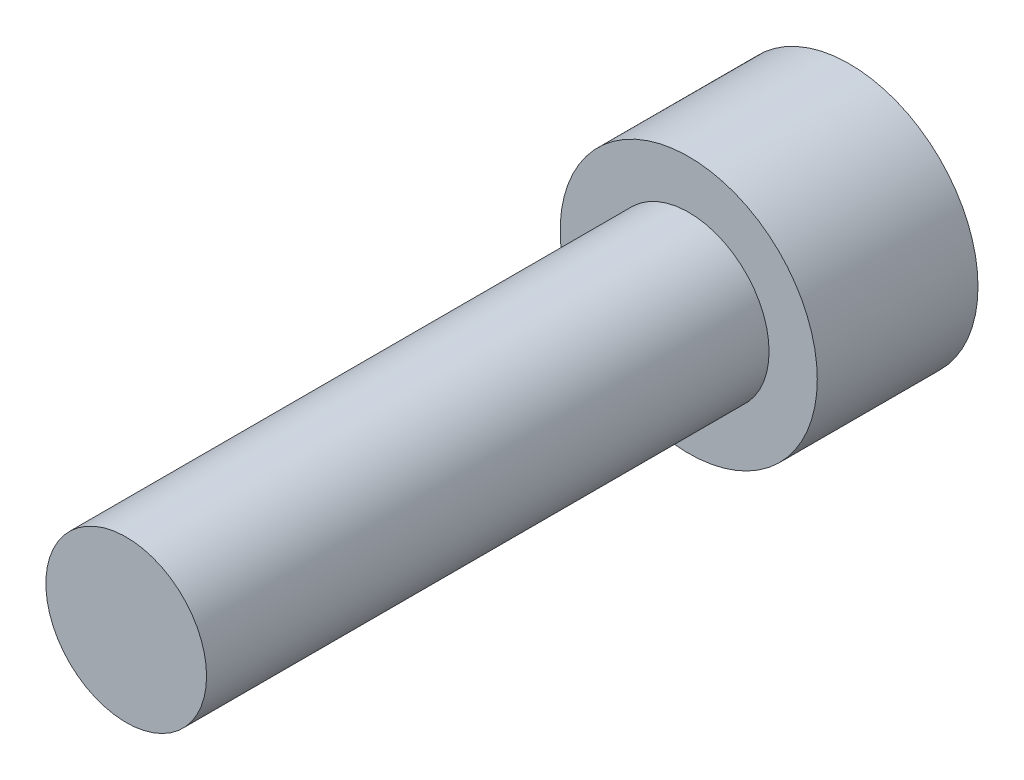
ISO-10303-21;
HEADER;
FILE_DESCRIPTION(('STEP AP214'),'2;1');
FILE_NAME('part.step','',(''),(''),'','','');
FILE_SCHEMA(('AUTOMOTIVE_DESIGN { 1 0 10303 214 1 1 1 1 }'));
ENDSEC;
DATA;
#1=APPLICATION_CONTEXT('core data for automotive mechanical design processes');
#2=APPLICATION_PROTOCOL_DEFINITION('international standard','automotive_design',2000,#1);
#3=PRODUCT_CONTEXT('',#1,'mechanical');
#4=PRODUCT('Part','Part','',(#3));
#5=PRODUCT_RELATED_PRODUCT_CATEGORY('part','',(#4));
#6=PRODUCT_DEFINITION_FORMATION('','',#4);
#7=PRODUCT_DEFINITION_CONTEXT('part definition',#1,'design');
#8=PRODUCT_DEFINITION('design','',#6,#7);
#9=PRODUCT_DEFINITION_SHAPE('','',#8);
#10=(LENGTH_UNIT() NAMED_UNIT(*) SI_UNIT(.MILLI.,.METRE.));
#11=(NAMED_UNIT(*) PLANE_ANGLE_UNIT() SI_UNIT($,.RADIAN.));
#12=(NAMED_UNIT(*) SI_UNIT($,.STERADIAN.) SOLID_ANGLE_UNIT());
#13=UNCERTAINTY_MEASURE_WITH_UNIT(LENGTH_MEASURE(1.E-05),#10,'distance_accuracy_value','');
#14=(GEOMETRIC_REPRESENTATION_CONTEXT(3) GLOBAL_UNCERTAINTY_ASSIGNED_CONTEXT((#13)) GLOBAL_UNIT_ASSIGNED_CONTEXT((#10,
#11,#12)) REPRESENTATION_CONTEXT('',''));
#15=CARTESIAN_POINT('',(0.,0.,0.));
#16=DIRECTION('',(0.,0.,1.));
#17=DIRECTION('',(1.,0.,0.));
#18=AXIS2_PLACEMENT_3D('',#15,#16,#17);
#19=CARTESIAN_POINT('',(0.,0.,35.));
#20=DIRECTION('',(0.,0.,1.));
#21=DIRECTION('',(1.,0.,0.));
#22=AXIS2_PLACEMENT_3D('',#19,#20,#21);
#23=PLANE('',#22);
#24=CARTESIAN_POINT('',(0.,0.,35.));
#25=DIRECTION('',(0.,0.,1.));
#26=DIRECTION('',(1.,0.,0.));
#27=AXIS2_PLACEMENT_3D('',#24,#25,#26);
#28=CIRCLE('',#27,5.);
#29=CARTESIAN_POINT('',(5.,0.,35.));
#30=VERTEX_POINT('',#29);
#31=EDGE_CURVE('E11',#30,#30,#28,.T.);
#32=ORIENTED_EDGE('',*,*,#31,.T.);
#33=EDGE_LOOP('',(#32));
#34=FACE_BOUND('',#33,.T.);
#35=ADVANCED_FACE('F32',(#34),#23,.T.);
#36=CARTESIAN_POINT('',(0.,0.,35.));
#37=DIRECTION('',(0.,0.,1.));
#38=DIRECTION('',(1.,0.,0.));
#39=AXIS2_PLACEMENT_3D('',#36,#37,#38);
#40=CYLINDRICAL_SURFACE('',#39,5.);
#41=CARTESIAN_POINT('',(0.,0.,0.));
#42=DIRECTION('',(0.,0.,1.));
#43=DIRECTION('',(1.,0.,0.));
#44=AXIS2_PLACEMENT_3D('',#41,#42,#43);
#45=CIRCLE('',#44,5.);
#46=CARTESIAN_POINT('',(5.,0.,0.));
#47=VERTEX_POINT('',#46);
#48=EDGE_CURVE('E39',#47,#47,#45,.T.);
#49=ORIENTED_EDGE('',*,*,#48,.T.);
#50=EDGE_LOOP('',(#49));
#51=FACE_BOUND('',#50,.T.);
#52=ORIENTED_EDGE('',*,*,#31,.F.);
#53=EDGE_LOOP('',(#52));
#54=FACE_BOUND('',#53,.T.);
#55=ADVANCED_FACE('F146',(#51,#54),#40,.T.);
#56=CARTESIAN_POINT('',(0.,-5.,0.));
#57=DIRECTION('',(0.,0.,1.));
#58=DIRECTION('',(1.,0.,0.));
#59=AXIS2_PLACEMENT_3D('',#56,#57,#58);
#60=PLANE('',#59);
#61=CARTESIAN_POINT('',(0.,0.,0.));
#62=DIRECTION('',(0.,0.,1.));
#63=DIRECTION('',(1.,0.,0.));
#64=AXIS2_PLACEMENT_3D('',#61,#62,#63);
#65=CIRCLE('',#64,8.);
#66=CARTESIAN_POINT('',(8.,0.,0.));
#67=VERTEX_POINT('',#66);
#68=EDGE_CURVE('E141',#67,#67,#65,.T.);
#69=ORIENTED_EDGE('',*,*,#68,.T.);
#70=EDGE_LOOP('',(#69));
#71=FACE_BOUND('',#70,.T.);
#72=ORIENTED_EDGE('',*,*,#48,.F.);
#73=EDGE_LOOP('',(#72));
#74=FACE_BOUND('',#73,.T.);
#75=ADVANCED_FACE('F149',(#71,#74),#60,.T.);
#76=CARTESIAN_POINT('',(0.,0.,35.));
#77=DIRECTION('',(0.,0.,1.));
#78=DIRECTION('',(1.,0.,0.));
#79=AXIS2_PLACEMENT_3D('',#76,#77,#78);
#80=CYLINDRICAL_SURFACE('',#79,8.);
#81=CARTESIAN_POINT('',(0.,0.,-9.99999999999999));
#82=DIRECTION('',(0.,0.,1.));
#83=DIRECTION('',(1.,0.,0.));
#84=AXIS2_PLACEMENT_3D('',#81,#82,#83);
#85=CIRCLE('',#84,8.);
#86=CARTESIAN_POINT('',(8.,0.,-9.99999999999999));
#87=VERTEX_POINT('',#86);
#88=EDGE_CURVE('E133',#87,#87,#85,.T.);
#89=ORIENTED_EDGE('',*,*,#88,.T.);
#90=EDGE_LOOP('',(#89));
#91=FACE_BOUND('',#90,.T.);
#92=ORIENTED_EDGE('',*,*,#68,.F.);
#93=EDGE_LOOP('',(#92));
#94=FACE_BOUND('',#93,.T.);
#95=ADVANCED_FACE('F151',(#91,#94),#80,.T.);
#96=CARTESIAN_POINT('',(0.,-8.,-10.));
#97=DIRECTION('',(0.,0.,-1.));
#98=DIRECTION('',(-1.,0.,0.));
#99=AXIS2_PLACEMENT_3D('',#96,#97,#98);
#100=PLANE('',#99);
#101=DIRECTION('',(0.866025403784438,-0.5,0.));
#102=VECTOR('',#101,1.);
#103=CARTESIAN_POINT('',(0.,4.61880215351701,-10.));
#104=LINE('',#103,#102);
#105=CARTESIAN_POINT('',(0.,4.61880215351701,-10.));
#106=VERTEX_POINT('',#105);
#107=CARTESIAN_POINT('',(4.,2.3094010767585,-10.));
#108=VERTEX_POINT('',#107);
#109=EDGE_CURVE('E46',#106,#108,#104,.T.);
#110=ORIENTED_EDGE('',*,*,#109,.F.);
#111=DIRECTION('',(0.866025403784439,0.5,0.));
#112=VECTOR('',#111,1.);
#113=CARTESIAN_POINT('',(-4.,2.3094010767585,-10.));
#114=LINE('',#113,#112);
#115=CARTESIAN_POINT('',(-4.,2.3094010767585,-10.));
#116=VERTEX_POINT('',#115);
#117=EDGE_CURVE('E129',#116,#106,#114,.T.);
#118=ORIENTED_EDGE('',*,*,#117,.F.);
#119=DIRECTION('',(0.,1.,0.));
#120=VECTOR('',#119,1.);
#121=CARTESIAN_POINT('',(-4.,-2.3094010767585,-10.));
#122=LINE('',#121,#120);
#123=CARTESIAN_POINT('',(-4.,-2.3094010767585,-10.));
#124=VERTEX_POINT('',#123);
#125=EDGE_CURVE('E127',#124,#116,#122,.T.);
#126=ORIENTED_EDGE('',*,*,#125,.F.);
#127=DIRECTION('',(-0.866025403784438,0.5,0.));
#128=VECTOR('',#127,1.);
#129=CARTESIAN_POINT('',(0.,-4.61880215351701,-10.));
#130=LINE('',#129,#128);
#131=CARTESIAN_POINT('',(0.,-4.61880215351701,-10.));
#132=VERTEX_POINT('',#131);
#133=EDGE_CURVE('E94',#132,#124,#130,.T.);
#134=ORIENTED_EDGE('',*,*,#133,.F.);
#135=DIRECTION('',(-0.866025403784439,-0.5,0.));
#136=VECTOR('',#135,1.);
#137=CARTESIAN_POINT('',(4.,-2.3094010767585,-10.));
#138=LINE('',#137,#136);
#139=CARTESIAN_POINT('',(4.,-2.3094010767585,-10.));
#140=VERTEX_POINT('',#139);
#141=EDGE_CURVE('E123',#140,#132,#138,.T.);
#142=ORIENTED_EDGE('',*,*,#141,.F.);
#143=DIRECTION('',(0.,-1.,0.));
#144=VECTOR('',#143,1.);
#145=CARTESIAN_POINT('',(4.,2.3094010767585,-10.));
#146=LINE('',#145,#144);
#147=EDGE_CURVE('E120',#108,#140,#146,.T.);
#148=ORIENTED_EDGE('',*,*,#147,.F.);
#149=EDGE_LOOP('',(#110,#118,#126,#134,#142,#148));
#150=FACE_BOUND('',#149,.T.);
#151=ORIENTED_EDGE('',*,*,#88,.F.);
#152=EDGE_LOOP('',(#151));
#153=FACE_BOUND('',#152,.T.);
#154=ADVANCED_FACE('F158',(#150,#153),#100,.T.);
#155=CARTESIAN_POINT('',(0.,4.61880215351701,-2.));
#156=DIRECTION('',(0.5,0.866025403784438,0.));
#157=DIRECTION('',(-0.866025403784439,0.5,0.));
#158=AXIS2_PLACEMENT_3D('',#155,#156,#157);
#159=PLANE('',#158);
#160=ORIENTED_EDGE('',*,*,#109,.T.);
#161=DIRECTION('',(0.,0.,-1.));
#162=VECTOR('',#161,1.);
#163=CARTESIAN_POINT('',(4.,2.3094010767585,-2.));
#164=LINE('',#163,#162);
#165=CARTESIAN_POINT('',(4.,2.3094010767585,-2.));
#166=VERTEX_POINT('',#165);
#167=EDGE_CURVE('E76',#166,#108,#164,.T.);
#168=ORIENTED_EDGE('',*,*,#167,.F.);
#169=DIRECTION('',(0.866025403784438,-0.5,0.));
#170=VECTOR('',#169,1.);
#171=CARTESIAN_POINT('',(0.,4.61880215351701,-2.));
#172=LINE('',#171,#170);
#173=CARTESIAN_POINT('',(0.,4.61880215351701,-2.));
#174=VERTEX_POINT('',#173);
#175=EDGE_CURVE('E131',#174,#166,#172,.T.);
#176=ORIENTED_EDGE('',*,*,#175,.F.);
#177=DIRECTION('',(0.,0.,-1.));
#178=VECTOR('',#177,1.);
#179=CARTESIAN_POINT('',(0.,4.61880215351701,-2.));
#180=LINE('',#179,#178);
#181=EDGE_CURVE('E54',#174,#106,#180,.T.);
#182=ORIENTED_EDGE('',*,*,#181,.T.);
#183=EDGE_LOOP('',(#160,#168,#176,#182));
#184=FACE_BOUND('',#183,.T.);
#185=ADVANCED_FACE('F189',(#184),#159,.F.);
#186=CARTESIAN_POINT('',(-4.,2.3094010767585,-2.));
#187=DIRECTION('',(-0.5,0.866025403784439,0.));
#188=DIRECTION('',(-0.866025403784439,-0.5,0.));
#189=AXIS2_PLACEMENT_3D('',#186,#187,#188);
#190=PLANE('',#189);
#191=ORIENTED_EDGE('',*,*,#117,.T.);
#192=ORIENTED_EDGE('',*,*,#181,.F.);
#193=DIRECTION('',(0.866025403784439,0.5,0.));
#194=VECTOR('',#193,1.);
#195=CARTESIAN_POINT('',(-4.,2.3094010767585,-2.));
#196=LINE('',#195,#194);
#197=CARTESIAN_POINT('',(-4.,2.3094010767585,-2.));
#198=VERTEX_POINT('',#197);
#199=EDGE_CURVE('E106',#198,#174,#196,.T.);
#200=ORIENTED_EDGE('',*,*,#199,.F.);
#201=DIRECTION('',(0.,0.,-1.));
#202=VECTOR('',#201,1.);
#203=CARTESIAN_POINT('',(-4.,2.3094010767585,-2.));
#204=LINE('',#203,#202);
#205=EDGE_CURVE('E98',#198,#116,#204,.T.);
#206=ORIENTED_EDGE('',*,*,#205,.T.);
#207=EDGE_LOOP('',(#191,#192,#200,#206));
#208=FACE_BOUND('',#207,.T.);
#209=ADVANCED_FACE('F199',(#208),#190,.F.);
#210=CARTESIAN_POINT('',(-4.,-2.3094010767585,-2.));
#211=DIRECTION('',(-1.,0.,0.));
#212=DIRECTION('',(0.,0.,1.));
#213=AXIS2_PLACEMENT_3D('',#210,#211,#212);
#214=PLANE('',#213);
#215=ORIENTED_EDGE('',*,*,#125,.T.);
#216=ORIENTED_EDGE('',*,*,#205,.F.);
#217=DIRECTION('',(0.,1.,0.));
#218=VECTOR('',#217,1.);
#219=CARTESIAN_POINT('',(-4.,-2.3094010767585,-2.));
#220=LINE('',#219,#218);
#221=CARTESIAN_POINT('',(-4.,-2.3094010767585,-2.));
#222=VERTEX_POINT('',#221);
#223=EDGE_CURVE('E102',#222,#198,#220,.T.);
#224=ORIENTED_EDGE('',*,*,#223,.F.);
#225=DIRECTION('',(0.,0.,-1.));
#226=VECTOR('',#225,1.);
#227=CARTESIAN_POINT('',(-4.,-2.3094010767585,-2.));
#228=LINE('',#227,#226);
#229=EDGE_CURVE('E87',#222,#124,#228,.T.);
#230=ORIENTED_EDGE('',*,*,#229,.T.);
#231=EDGE_LOOP('',(#215,#216,#224,#230));
#232=FACE_BOUND('',#231,.T.);
#233=ADVANCED_FACE('F103',(#232),#214,.F.);
#234=CARTESIAN_POINT('',(0.,-4.61880215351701,-2.));
#235=DIRECTION('',(-0.5,-0.866025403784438,0.));
#236=DIRECTION('',(0.866025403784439,-0.5,0.));
#237=AXIS2_PLACEMENT_3D('',#234,#235,#236);
#238=PLANE('',#237);
#239=ORIENTED_EDGE('',*,*,#133,.T.);
#240=ORIENTED_EDGE('',*,*,#229,.F.);
#241=DIRECTION('',(-0.866025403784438,0.5,0.));
#242=VECTOR('',#241,1.);
#243=CARTESIAN_POINT('',(0.,-4.61880215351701,-2.));
#244=LINE('',#243,#242);
#245=CARTESIAN_POINT('',(0.,-4.61880215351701,-2.));
#246=VERTEX_POINT('',#245);
#247=EDGE_CURVE('E91',#246,#222,#244,.T.);
#248=ORIENTED_EDGE('',*,*,#247,.F.);
#249=DIRECTION('',(0.,0.,-1.));
#250=VECTOR('',#249,1.);
#251=CARTESIAN_POINT('',(0.,-4.61880215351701,-2.));
#252=LINE('',#251,#250);
#253=EDGE_CURVE('E99',#246,#132,#252,.T.);
#254=ORIENTED_EDGE('',*,*,#253,.T.);
#255=EDGE_LOOP('',(#239,#240,#248,#254));
#256=FACE_BOUND('',#255,.T.);
#257=ADVANCED_FACE('F89',(#256),#238,.F.);
#258=CARTESIAN_POINT('',(4.,-2.3094010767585,-2.));
#259=DIRECTION('',(0.5,-0.866025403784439,0.));
#260=DIRECTION('',(0.866025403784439,0.5,0.));
#261=AXIS2_PLACEMENT_3D('',#258,#259,#260);
#262=PLANE('',#261);
#263=ORIENTED_EDGE('',*,*,#141,.T.);
#264=ORIENTED_EDGE('',*,*,#253,.F.);
#265=DIRECTION('',(-0.866025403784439,-0.5,0.));
#266=VECTOR('',#265,1.);
#267=CARTESIAN_POINT('',(4.,-2.3094010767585,-2.));
#268=LINE('',#267,#266);
#269=CARTESIAN_POINT('',(4.,-2.3094010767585,-2.));
#270=VERTEX_POINT('',#269);
#271=EDGE_CURVE('E112',#270,#246,#268,.T.);
#272=ORIENTED_EDGE('',*,*,#271,.F.);
#273=DIRECTION('',(0.,0.,-1.));
#274=VECTOR('',#273,1.);
#275=CARTESIAN_POINT('',(4.,-2.3094010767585,-2.));
#276=LINE('',#275,#274);
#277=EDGE_CURVE('E136',#270,#140,#276,.T.);
#278=ORIENTED_EDGE('',*,*,#277,.T.);
#279=EDGE_LOOP('',(#263,#264,#272,#278));
#280=FACE_BOUND('',#279,.T.);
#281=ADVANCED_FACE('F224',(#280),#262,.F.);
#282=CARTESIAN_POINT('',(4.,2.3094010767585,-2.));
#283=DIRECTION('',(1.,0.,0.));
#284=DIRECTION('',(0.,0.,-1.));
#285=AXIS2_PLACEMENT_3D('',#282,#283,#284);
#286=PLANE('',#285);
#287=ORIENTED_EDGE('',*,*,#147,.T.);
#288=ORIENTED_EDGE('',*,*,#277,.F.);
#289=DIRECTION('',(0.,-1.,0.));
#290=VECTOR('',#289,1.);
#291=CARTESIAN_POINT('',(4.,2.3094010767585,-2.));
#292=LINE('',#291,#290);
#293=EDGE_CURVE('E114',#166,#270,#292,.T.);
#294=ORIENTED_EDGE('',*,*,#293,.F.);
#295=ORIENTED_EDGE('',*,*,#167,.T.);
#296=EDGE_LOOP('',(#287,#288,#294,#295));
#297=FACE_BOUND('',#296,.T.);
#298=ADVANCED_FACE('F233',(#297),#286,.F.);
#299=CARTESIAN_POINT('',(8.,0.,-2.));
#300=DIRECTION('',(0.,0.,-1.));
#301=DIRECTION('',(-1.,0.,0.));
#302=AXIS2_PLACEMENT_3D('',#299,#300,#301);
#303=PLANE('',#302);
#304=ORIENTED_EDGE('',*,*,#175,.T.);
#305=ORIENTED_EDGE('',*,*,#293,.T.);
#306=ORIENTED_EDGE('',*,*,#271,.T.);
#307=ORIENTED_EDGE('',*,*,#247,.T.);
#308=ORIENTED_EDGE('',*,*,#223,.T.);
#309=ORIENTED_EDGE('',*,*,#199,.T.);
#310=EDGE_LOOP('',(#304,#305,#306,#307,#308,#309));
#311=FACE_BOUND('',#310,.T.);
#312=ADVANCED_FACE('F109',(#311),#303,.T.);
#313=CLOSED_SHELL('',(#35,#55,#75,#95,#154,#185,#209,#233,#257,#281,#298,#312));
#314=MANIFOLD_SOLID_BREP('B2',#313);
#315=ADVANCED_BREP_SHAPE_REPRESENTATION('',(#18,#314),#14);
#316=SHAPE_DEFINITION_REPRESENTATION(#9,#315);
ENDSEC;
END-ISO-10303-21;
